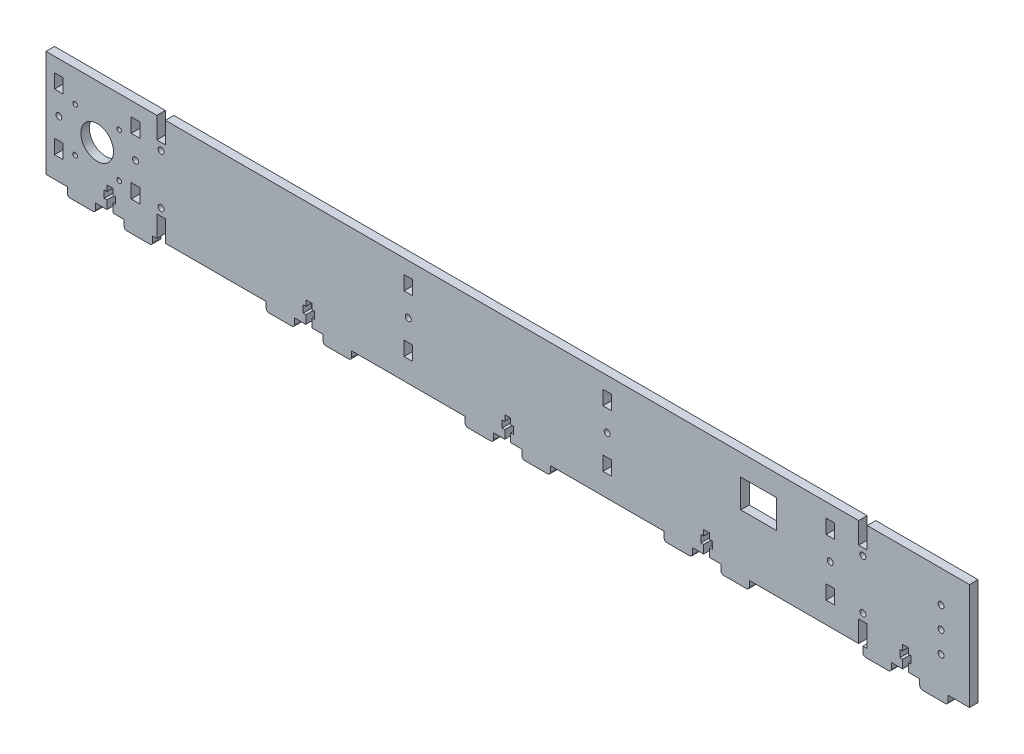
from build123d import *

# Parameters (mm, degrees)
SKETCH_1_R          = 1.6
SKETCH_1_R_2        = 2.1
SKETCH_1_R_3        = 11.5
EXTRUDE_1_DEPTH     = 6
SKETCH_2_R          = 2.1
SKETCH_2_W          = 6
SKETCH_2_H          = 10
CUT_EXTRUDE_1_DEPTH = 655.340125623
SKETCH_3_R          = 2.1
SKETCH_3_W          = 6
SKETCH_3_H          = 15
CUT_EXTRUDE_2_DEPTH = 655.340125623
SKETCH_4_W          = 25
SKETCH_4_H          = 20
CUT_EXTRUDE_3_DEPTH = 655.340125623


with BuildPart() as part:
    # Sketch 1 → Extrude 1 (new body)
    with BuildSketch(Plane.XY):
        with BuildLine():
            Line((0, 75), (0, 0))
            Line((0, 0), (15, 0))
            Line((15, 0), (15, -4))
            ThreePointArc((15, -4), (15.585786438, -5.414213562), (17, -6))
            Line((17, -6), (33, -6))
            ThreePointArc((33, -6), (34.414213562, -5.414213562), (35, -4))
            Line((35, -4), (35, 0))
            Line((35, 0), (42.9, 0))
            Line((42.9, 0), (42.9, 5.9))
            Line((42.9, 5.9), (41, 5.9))
            Line((41, 5.9), (41, 11))
            Line((41, 11), (42.9, 11))
            Line((42.9, 11), (42.9, 15))
            Line((42.9, 15), (47.1, 15))
            Line((47.1, 15), (47.1, 11))
            Line((47.1, 11), (49, 11))
            Line((49, 11), (49, 5.9))
            Line((49, 5.9), (47.1, 5.9))
            Line((47.1, 5.9), (47.1, 0))
            Line((47.1, 0), (55, 0))
            Line((55, 0), (55, -4))
            ThreePointArc((55, -4), (55.585786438, -5.414213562), (57, -6))
            Line((57, -6), (73, -6))
            ThreePointArc((73, -6), (74.414213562, -5.414213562), (75, -4))
            Line((75, -4), (75, 0))
            Line((75, 0), (155, 0))
            Line((155, 0), (155, -4))
            ThreePointArc((155, -4), (155.585786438, -5.414213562), (157, -6))
            Line((157, -6), (173, -6))
            ThreePointArc((173, -6), (174.414213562, -5.414213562), (175, -4))
            Line((175, -4), (175, 0))
            Line((175, 0), (182.9, 0))
            Line((182.9, 0), (182.9, 5.9))
            Line((182.9, 5.9), (181, 5.9))
            Line((181, 5.9), (181, 11))
            Line((181, 11), (182.9, 11))
            Line((182.9, 11), (182.9, 15))
            Line((182.9, 15), (187.1, 15))
            Line((187.1, 15), (187.1, 11))
            Line((187.1, 11), (189, 11))
            Line((189, 11), (189, 5.9))
            Line((189, 5.9), (187.1, 5.9))
            Line((187.1, 5.9), (187.1, 0))
            Line((187.1, 0), (195, 0))
            Line((195, 0), (195, -4))
            ThreePointArc((195, -4), (195.585786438, -5.414213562), (197, -6))
            Line((197, -6), (213, -6))
            ThreePointArc((213, -6), (214.414213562, -5.414213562), (215, -4))
            Line((215, -4), (215, 0))
            Line((215, 0), (295, 0))
            Line((295, 0), (295, -4))
            ThreePointArc((295, -4), (295.585786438, -5.414213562), (297, -6))
            Line((297, -6), (313, -6))
            ThreePointArc((313, -6), (314.414213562, -5.414213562), (315, -4))
            Line((315, -4), (315, 0))
            Line((315, 0), (322.9, 0))
            Line((322.9, 0), (322.9, 5.9))
            Line((322.9, 5.9), (321, 5.9))
            Line((321, 5.9), (321, 11))
            Line((321, 11), (322.9, 11))
            Line((322.9, 11), (322.9, 15))
            Line((322.9, 15), (327.1, 15))
            Line((327.1, 15), (327.1, 11))
            Line((327.1, 11), (329, 11))
            Line((329, 11), (329, 5.9))
            Line((329, 5.9), (327.1, 5.9))
            Line((327.1, 5.9), (327.1, 0))
            Line((327.1, 0), (335, 0))
            Line((335, 0), (335, -4))
            ThreePointArc((335, -4), (335.585786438, -5.414213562), (337, -6))
            Line((337, -6), (353, -6))
            ThreePointArc((353, -6), (354.414213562, -5.414213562), (355, -4))
            Line((355, -4), (355, 0))
            Line((355, 0), (435, 0))
            Line((435, 0), (435, -4))
            ThreePointArc((435, -4), (435.585786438, -5.414213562), (437, -6))
            Line((437, -6), (453, -6))
            ThreePointArc((453, -6), (454.414213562, -5.414213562), (455, -4))
            Line((455, -4), (455, 0))
            Line((455, 0), (462.9, 0))
            Line((462.9, 0), (462.9, 5.9))
            Line((462.9, 5.9), (461, 5.9))
            Line((461, 5.9), (461, 11))
            Line((461, 11), (462.9, 11))
            Line((462.9, 11), (462.9, 15))
            Line((462.9, 15), (467.1, 15))
            Line((467.1, 15), (467.1, 11))
            Line((467.1, 11), (469, 11))
            Line((469, 11), (469, 5.9))
            Line((469, 5.9), (467.1, 5.9))
            Line((467.1, 5.9), (467.1, 0))
            Line((467.1, 0), (475, 0))
            Line((475, 0), (475, -4))
            ThreePointArc((475, -4), (475.585786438, -5.414213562), (477, -6))
            Line((477, -6), (493, -6))
            ThreePointArc((493, -6), (494.414213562, -5.414213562), (495, -4))
            Line((495, -4), (495, 0))
            Line((495, 0), (575, 0))
            Line((575, 0), (575, -4))
            ThreePointArc((575, -4), (575.585786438, -5.414213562), (577, -6))
            Line((577, -6), (593, -6))
            ThreePointArc((593, -6), (594.414213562, -5.414213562), (595, -4))
            Line((595, -4), (595, 0))
            Line((595, 0), (602.9, 0))
            Line((602.9, 0), (602.9, 5.9))
            Line((602.9, 5.9), (601, 5.9))
            Line((601, 5.9), (601, 11))
            Line((601, 11), (602.9, 11))
            Line((602.9, 11), (602.9, 15))
            Line((602.9, 15), (607.1, 15))
            Line((607.1, 15), (607.1, 11))
            Line((607.1, 11), (609, 11))
            Line((609, 11), (609, 5.9))
            Line((609, 5.9), (607.1, 5.9))
            Line((607.1, 5.9), (607.1, 0))
            Line((607.1, 0), (615, 0))
            Line((615, 0), (615, -4))
            ThreePointArc((615, -4), (615.585786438, -5.414213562), (617, -6))
            Line((617, -6), (633, -6))
            ThreePointArc((633, -6), (634.414213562, -5.414213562), (635, -4))
            Line((635, -4), (635, 0))
            Line((635, 0), (650, 0))
            Line((650, 0), (650, 75))
            Line((650, 75), (0, 75))
        make_face()
        with Locations((20.5, 22)):
            Circle(SKETCH_1_R, mode=Mode.SUBTRACT)
        with Locations((51.5, 22)):
            Circle(SKETCH_1_R, mode=Mode.SUBTRACT)
        with Locations((630, 22.5)):
            Circle(SKETCH_1_R_2, mode=Mode.SUBTRACT)
        with Locations((36, 37.5)):
            Circle(SKETCH_1_R_3, mode=Mode.SUBTRACT)
        with Locations((20.5, 53)):
            Circle(SKETCH_1_R, mode=Mode.SUBTRACT)
        with Locations((51.5, 53)):
            Circle(SKETCH_1_R, mode=Mode.SUBTRACT)
        with Locations((630, 37.5)):
            Circle(SKETCH_1_R_2, mode=Mode.SUBTRACT)
        with Locations((630, 52.5)):
            Circle(SKETCH_1_R_2, mode=Mode.SUBTRACT)
    extrude(amount=EXTRUDE_1_DEPTH)

    # Sketch 2 → Cut-Extrude 1 (cut, through all)
    with BuildSketch(Plane.XY.offset(6)):
        with Locations((9, 40)):
            Circle(SKETCH_2_R)
        with Locations((63, 40)):
            Circle(SKETCH_2_R)
        with Locations((552, 40)):
            Circle(SKETCH_2_R)
        with Locations((395, 40)):
            Circle(SKETCH_2_R)
        with Locations((255, 40)):
            Circle(SKETCH_2_R)
        with Locations((63, 60)):
            Rectangle(SKETCH_2_W, SKETCH_2_H)
        with Locations((63, 20)):
            Rectangle(SKETCH_2_W, SKETCH_2_H)
        with Locations((9, 60)):
            Rectangle(SKETCH_2_W, SKETCH_2_H)
        with Locations((9, 20)):
            Rectangle(SKETCH_2_W, SKETCH_2_H)
        with Locations((255, 60)):
            Rectangle(SKETCH_2_W, SKETCH_2_H)
        with Locations((255, 20)):
            Rectangle(SKETCH_2_W, SKETCH_2_H)
        with Locations((395, 60)):
            Rectangle(SKETCH_2_W, SKETCH_2_H)
        with Locations((395, 20)):
            Rectangle(SKETCH_2_W, SKETCH_2_H)
        with Locations((552, 60)):
            Rectangle(SKETCH_2_W, SKETCH_2_H)
        with Locations((552, 20)):
            Rectangle(SKETCH_2_W, SKETCH_2_H)
    extrude(amount=-CUT_EXTRUDE_1_DEPTH, mode=Mode.SUBTRACT)

    # Sketch 3 → Cut-Extrude 2 (cut, through all)
    with BuildSketch(Plane.XY.offset(6)):
        with Locations((81, 55)):
            Circle(SKETCH_3_R)
        with Locations((81, 20)):
            Circle(SKETCH_3_R)
        with Locations((575, 55)):
            Circle(SKETCH_3_R)
        with Locations((575, 20)):
            Circle(SKETCH_3_R)
        with Locations((81, 67.5)):
            Rectangle(SKETCH_3_W, SKETCH_3_H)
        with Locations((81, 7.5)):
            Rectangle(SKETCH_3_W, SKETCH_3_H)
        with Locations((575, 67.5)):
            Rectangle(SKETCH_3_W, SKETCH_3_H)
        with Locations((575, 7.5)):
            Rectangle(SKETCH_3_W, SKETCH_3_H)
    extrude(amount=-CUT_EXTRUDE_2_DEPTH, mode=Mode.SUBTRACT)

    # Sketch 4 → Cut-Extrude 3 (cut, through all)
    with BuildSketch(Plane.XY.offset(6)):
        with Locations((501.5, 50)):
            Rectangle(SKETCH_4_W, SKETCH_4_H)
    extrude(amount=-CUT_EXTRUDE_3_DEPTH, mode=Mode.SUBTRACT)


solid = part.part
